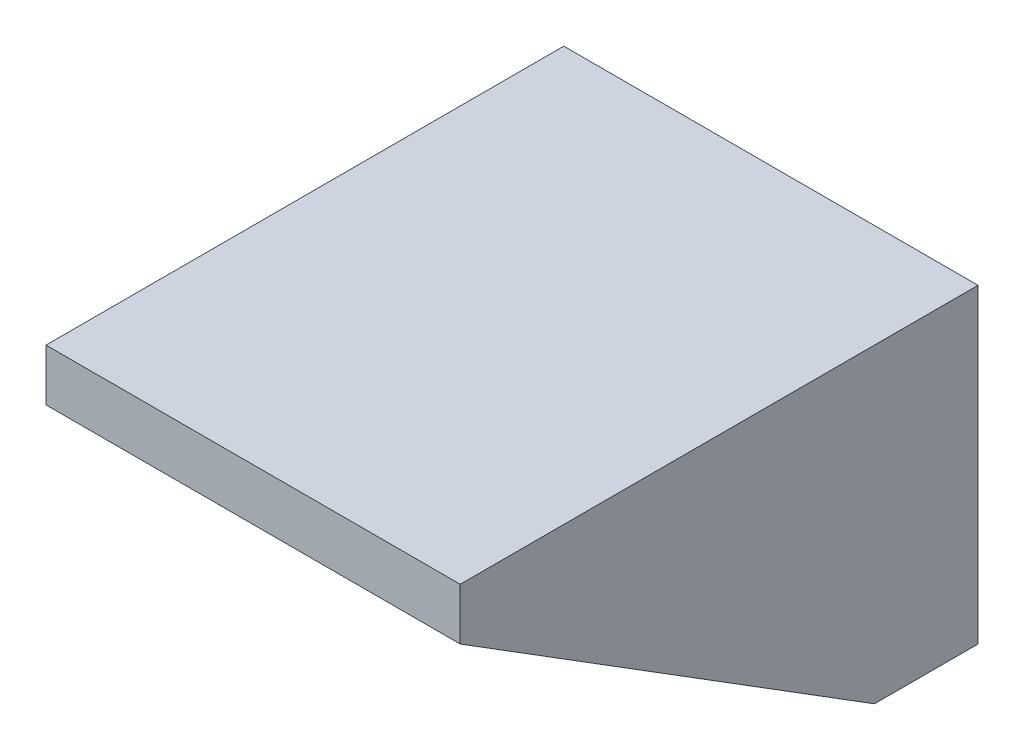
ISO-10303-21;
HEADER;
FILE_DESCRIPTION(('STEP AP214'),'2;1');
FILE_NAME('part.step','',(''),(''),'','','');
FILE_SCHEMA(('AUTOMOTIVE_DESIGN { 1 0 10303 214 1 1 1 1 }'));
ENDSEC;
DATA;
#1=APPLICATION_CONTEXT('core data for automotive mechanical design processes');
#2=APPLICATION_PROTOCOL_DEFINITION('international standard','automotive_design',2000,#1);
#3=PRODUCT_CONTEXT('',#1,'mechanical');
#4=PRODUCT('Part','Part','',(#3));
#5=PRODUCT_RELATED_PRODUCT_CATEGORY('part','',(#4));
#6=PRODUCT_DEFINITION_FORMATION('','',#4);
#7=PRODUCT_DEFINITION_CONTEXT('part definition',#1,'design');
#8=PRODUCT_DEFINITION('design','',#6,#7);
#9=PRODUCT_DEFINITION_SHAPE('','',#8);
#10=(LENGTH_UNIT() NAMED_UNIT(*) SI_UNIT(.MILLI.,.METRE.));
#11=(NAMED_UNIT(*) PLANE_ANGLE_UNIT() SI_UNIT($,.RADIAN.));
#12=(NAMED_UNIT(*) SI_UNIT($,.STERADIAN.) SOLID_ANGLE_UNIT());
#13=UNCERTAINTY_MEASURE_WITH_UNIT(LENGTH_MEASURE(1.E-05),#10,'distance_accuracy_value','');
#14=(GEOMETRIC_REPRESENTATION_CONTEXT(3) GLOBAL_UNCERTAINTY_ASSIGNED_CONTEXT((#13)) GLOBAL_UNIT_ASSIGNED_CONTEXT((#10,
#11,#12)) REPRESENTATION_CONTEXT('',''));
#15=CARTESIAN_POINT('',(0.,0.,0.));
#16=DIRECTION('',(0.,0.,1.));
#17=DIRECTION('',(1.,0.,0.));
#18=AXIS2_PLACEMENT_3D('',#15,#16,#17);
#19=CARTESIAN_POINT('',(-40.,0.,19.9999999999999));
#20=DIRECTION('',(1.,0.,0.));
#21=DIRECTION('',(0.,1.,0.));
#22=AXIS2_PLACEMENT_3D('',#19,#20,#21);
#23=PLANE('',#22);
#24=DIRECTION('',(0.,-1.,0.));
#25=VECTOR('',#24,1.);
#26=CARTESIAN_POINT('',(-40.0000000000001,-2.22044604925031E-13,-1.94289029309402E-13));
#27=LINE('',#26,#25);
#28=CARTESIAN_POINT('',(-40.0000000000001,-2.22044604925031E-13,-1.94289029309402E-13));
#29=VERTEX_POINT('',#28);
#30=CARTESIAN_POINT('',(-40.0000000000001,-59.9999999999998,-1.66533453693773E-13));
#31=VERTEX_POINT('',#30);
#32=EDGE_CURVE('E104',#29,#31,#27,.T.);
#33=ORIENTED_EDGE('',*,*,#32,.T.);
#34=DIRECTION('',(0.,0.,-1.));
#35=VECTOR('',#34,1.);
#36=CARTESIAN_POINT('',(-40.0000000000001,-59.9999999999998,19.9999999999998));
#37=LINE('',#36,#35);
#38=CARTESIAN_POINT('',(-40.0000000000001,-59.9999999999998,19.9999999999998));
#39=VERTEX_POINT('',#38);
#40=EDGE_CURVE('E11',#39,#31,#37,.T.);
#41=ORIENTED_EDGE('',*,*,#40,.F.);
#42=DIRECTION('',(0.,0.52999894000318,0.847998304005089));
#43=VECTOR('',#42,1.);
#44=CARTESIAN_POINT('',(-40.0000000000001,-9.99999999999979,99.9999999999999));
#45=LINE('',#44,#43);
#46=CARTESIAN_POINT('',(-40.0000000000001,-9.99999999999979,99.9999999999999));
#47=VERTEX_POINT('',#46);
#48=EDGE_CURVE('E108',#39,#47,#45,.T.);
#49=ORIENTED_EDGE('',*,*,#48,.T.);
#50=DIRECTION('',(0.,1.,0.));
#51=VECTOR('',#50,1.);
#52=CARTESIAN_POINT('',(-40.0000000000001,3.33066907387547E-13,99.9999999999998));
#53=LINE('',#52,#51);
#54=CARTESIAN_POINT('',(-40.0000000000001,3.33066907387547E-13,99.9999999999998));
#55=VERTEX_POINT('',#54);
#56=EDGE_CURVE('E102',#47,#55,#53,.T.);
#57=ORIENTED_EDGE('',*,*,#56,.T.);
#58=DIRECTION('',(0.,0.,-1.));
#59=VECTOR('',#58,1.);
#60=CARTESIAN_POINT('',(-40.,0.,19.9999999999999));
#61=LINE('',#60,#59);
#62=EDGE_CURVE('E83',#55,#29,#61,.T.);
#63=ORIENTED_EDGE('',*,*,#62,.T.);
#64=EDGE_LOOP('',(#33,#41,#49,#57,#63));
#65=FACE_BOUND('',#64,.T.);
#66=ADVANCED_FACE('F30',(#65),#23,.F.);
#67=CARTESIAN_POINT('',(-40.0000000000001,-59.9999999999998,19.9999999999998));
#68=DIRECTION('',(0.,1.,0.));
#69=DIRECTION('',(0.,0.,1.));
#70=AXIS2_PLACEMENT_3D('',#67,#68,#69);
#71=PLANE('',#70);
#72=DIRECTION('',(1.,0.,0.));
#73=VECTOR('',#72,1.);
#74=CARTESIAN_POINT('',(-40.0000000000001,-59.9999999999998,-1.66533453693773E-13));
#75=LINE('',#74,#73);
#76=CARTESIAN_POINT('',(39.9999999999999,-59.9999999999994,0.));
#77=VERTEX_POINT('',#76);
#78=EDGE_CURVE('E107',#31,#77,#75,.T.);
#79=ORIENTED_EDGE('',*,*,#78,.T.);
#80=DIRECTION('',(0.,0.,-1.));
#81=VECTOR('',#80,1.);
#82=CARTESIAN_POINT('',(39.9999999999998,-59.9999999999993,20.));
#83=LINE('',#82,#81);
#84=CARTESIAN_POINT('',(39.9999999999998,-59.9999999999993,20.));
#85=VERTEX_POINT('',#84);
#86=EDGE_CURVE('E37',#85,#77,#83,.T.);
#87=ORIENTED_EDGE('',*,*,#86,.F.);
#88=DIRECTION('',(1.,0.,0.));
#89=VECTOR('',#88,1.);
#90=CARTESIAN_POINT('',(-40.0000000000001,-59.9999999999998,19.9999999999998));
#91=LINE('',#90,#89);
#92=EDGE_CURVE('E46',#39,#85,#91,.T.);
#93=ORIENTED_EDGE('',*,*,#92,.F.);
#94=ORIENTED_EDGE('',*,*,#40,.T.);
#95=EDGE_LOOP('',(#79,#87,#93,#94));
#96=FACE_BOUND('',#95,.T.);
#97=ADVANCED_FACE('F131',(#96),#71,.F.);
#98=CARTESIAN_POINT('',(40.,5.55111512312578E-13,20.));
#99=DIRECTION('',(-1.,0.,0.));
#100=DIRECTION('',(0.,-1.,0.));
#101=AXIS2_PLACEMENT_3D('',#98,#99,#100);
#102=PLANE('',#101);
#103=DIRECTION('',(0.,1.,0.));
#104=VECTOR('',#103,1.);
#105=CARTESIAN_POINT('',(40.,6.66133814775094E-13,0.));
#106=LINE('',#105,#104);
#107=CARTESIAN_POINT('',(40.,6.66133814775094E-13,0.));
#108=VERTEX_POINT('',#107);
#109=EDGE_CURVE('E80',#77,#108,#106,.T.);
#110=ORIENTED_EDGE('',*,*,#109,.T.);
#111=DIRECTION('',(0.,0.,-1.));
#112=VECTOR('',#111,1.);
#113=CARTESIAN_POINT('',(40.,5.55111512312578E-13,20.));
#114=LINE('',#113,#112);
#115=CARTESIAN_POINT('',(39.9999999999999,7.7715611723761E-13,100.));
#116=VERTEX_POINT('',#115);
#117=EDGE_CURVE('E73',#116,#108,#114,.T.);
#118=ORIENTED_EDGE('',*,*,#117,.F.);
#119=DIRECTION('',(0.,-1.,0.));
#120=VECTOR('',#119,1.);
#121=CARTESIAN_POINT('',(39.9999999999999,7.7715611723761E-13,100.));
#122=LINE('',#121,#120);
#123=CARTESIAN_POINT('',(39.9999999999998,-9.99999999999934,100.));
#124=VERTEX_POINT('',#123);
#125=EDGE_CURVE('E78',#116,#124,#122,.T.);
#126=ORIENTED_EDGE('',*,*,#125,.T.);
#127=DIRECTION('',(0.,-0.52999894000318,-0.847998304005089));
#128=VECTOR('',#127,1.);
#129=CARTESIAN_POINT('',(39.9999999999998,-9.99999999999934,100.));
#130=LINE('',#129,#128);
#131=EDGE_CURVE('E97',#124,#85,#130,.T.);
#132=ORIENTED_EDGE('',*,*,#131,.T.);
#133=ORIENTED_EDGE('',*,*,#86,.T.);
#134=EDGE_LOOP('',(#110,#118,#126,#132,#133));
#135=FACE_BOUND('',#134,.T.);
#136=ADVANCED_FACE('F75',(#135),#102,.F.);
#137=CARTESIAN_POINT('',(-40.,0.,19.9999999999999));
#138=DIRECTION('',(0.,-1.,0.));
#139=DIRECTION('',(0.,0.,-1.));
#140=AXIS2_PLACEMENT_3D('',#137,#138,#139);
#141=PLANE('',#140);
#142=DIRECTION('',(-1.,0.,0.));
#143=VECTOR('',#142,1.);
#144=CARTESIAN_POINT('',(-40.0000000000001,-2.22044604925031E-13,-1.94289029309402E-13));
#145=LINE('',#144,#143);
#146=EDGE_CURVE('E111',#108,#29,#145,.T.);
#147=ORIENTED_EDGE('',*,*,#146,.T.);
#148=ORIENTED_EDGE('',*,*,#62,.F.);
#149=DIRECTION('',(1.,0.,0.));
#150=VECTOR('',#149,1.);
#151=CARTESIAN_POINT('',(-140.,0.,99.9999999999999));
#152=LINE('',#151,#150);
#153=EDGE_CURVE('E86',#55,#116,#152,.T.);
#154=ORIENTED_EDGE('',*,*,#153,.T.);
#155=ORIENTED_EDGE('',*,*,#117,.T.);
#156=EDGE_LOOP('',(#147,#148,#154,#155));
#157=FACE_BOUND('',#156,.T.);
#158=ADVANCED_FACE('F87',(#157),#141,.F.);
#159=CARTESIAN_POINT('',(-40.0000000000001,-59.9999999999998,-1.66533453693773E-13));
#160=DIRECTION('',(0.,0.,1.));
#161=DIRECTION('',(1.,0.,0.));
#162=AXIS2_PLACEMENT_3D('',#159,#160,#161);
#163=PLANE('',#162);
#164=ORIENTED_EDGE('',*,*,#32,.F.);
#165=ORIENTED_EDGE('',*,*,#146,.F.);
#166=ORIENTED_EDGE('',*,*,#109,.F.);
#167=ORIENTED_EDGE('',*,*,#78,.F.);
#168=EDGE_LOOP('',(#164,#165,#166,#167));
#169=FACE_BOUND('',#168,.T.);
#170=ADVANCED_FACE('F116',(#169),#163,.F.);
#171=CARTESIAN_POINT('',(-140.,-10.,100.));
#172=DIRECTION('',(0.,-0.847998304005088,0.529998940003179));
#173=DIRECTION('',(0.,-0.52999894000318,-0.847998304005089));
#174=AXIS2_PLACEMENT_3D('',#171,#172,#173);
#175=PLANE('',#174);
#176=ORIENTED_EDGE('',*,*,#48,.F.);
#177=ORIENTED_EDGE('',*,*,#92,.T.);
#178=ORIENTED_EDGE('',*,*,#131,.F.);
#179=DIRECTION('',(1.,0.,0.));
#180=VECTOR('',#179,1.);
#181=CARTESIAN_POINT('',(-140.,-10.,100.));
#182=LINE('',#181,#180);
#183=EDGE_CURVE('E92',#47,#124,#182,.T.);
#184=ORIENTED_EDGE('',*,*,#183,.F.);
#185=EDGE_LOOP('',(#176,#177,#178,#184));
#186=FACE_BOUND('',#185,.T.);
#187=ADVANCED_FACE('F121',(#186),#175,.T.);
#188=CARTESIAN_POINT('',(-140.,0.,99.9999999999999));
#189=DIRECTION('',(0.,0.,1.));
#190=DIRECTION('',(1.,0.,0.));
#191=AXIS2_PLACEMENT_3D('',#188,#189,#190);
#192=PLANE('',#191);
#193=ORIENTED_EDGE('',*,*,#56,.F.);
#194=ORIENTED_EDGE('',*,*,#183,.T.);
#195=ORIENTED_EDGE('',*,*,#125,.F.);
#196=ORIENTED_EDGE('',*,*,#153,.F.);
#197=EDGE_LOOP('',(#193,#194,#195,#196));
#198=FACE_BOUND('',#197,.T.);
#199=ADVANCED_FACE('F94',(#198),#192,.T.);
#200=CLOSED_SHELL('',(#66,#97,#136,#158,#170,#187,#199));
#201=MANIFOLD_SOLID_BREP('B2',#200);
#202=ADVANCED_BREP_SHAPE_REPRESENTATION('',(#18,#201),#14);
#203=SHAPE_DEFINITION_REPRESENTATION(#9,#202);
ENDSEC;
END-ISO-10303-21;
